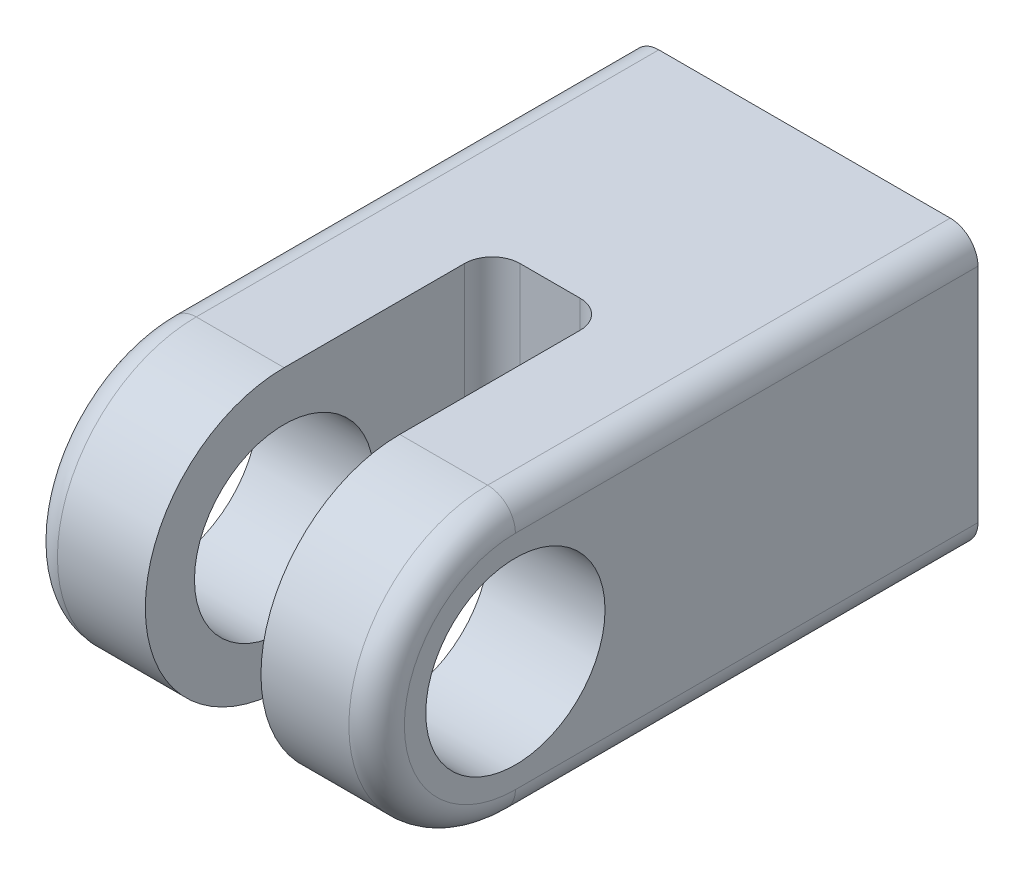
from build123d import *

# Parameters (mm, degrees)
EXTRUDE1_DEPTH          = 9.525
CUT_EXTRUDE1_DEPTH      = 36.201000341
CUT_EXTRUDE1_DEPTH_BACK = 36.201000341
SKETCH2_W               = 6.35
SKETCH2_H               = 19.05
SKETCH3_R               = 4.92125
CUT_EXTRUDE2_DEPTH      = 39.875278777
SKETCH4_R               = 6.35
CUT_EXTRUDE3_DEPTH      = 9.8425
FILLET1_R               = 1.524


with BuildPart() as part:
    # Sketch1 → Extrude1 (new, symmetric)
    with BuildSketch(Plane(origin=(0, 0, 0), x_dir=(0, 0, -1), z_dir=(1, 0, 0))):
        with BuildLine():
            Line((0, 7.62), (-25.4, 7.62))
            ThreePointArc((-25.4, 7.62), (-33.02, 0), (-25.4, -7.62))
            Line((-25.4, -7.62), (0, -7.62))
            Line((0, -7.62), (0, 7.62))
        make_face()
    extrude(amount=EXTRUDE1_DEPTH, both=True)

    # Sketch2 → Cut-Extrude1 (cut, two sides: drawn at the far end of the back side and taken through both)
    with BuildSketch(Plane(origin=(0, 0, 0), x_dir=(1, 0, 0), z_dir=(0, 1, 0)).offset(-CUT_EXTRUDE1_DEPTH_BACK)):
        with Locations((0, -23.495)):
            Rectangle(SKETCH2_W, SKETCH2_H)
    extrude(amount=CUT_EXTRUDE1_DEPTH + CUT_EXTRUDE1_DEPTH_BACK, mode=Mode.SUBTRACT)

    # Sketch3 → Cut-Extrude2 (cut, through all)
    with BuildSketch(Plane(origin=(9.525, 0, 0), x_dir=(0, 0, -1), z_dir=(1, 0, 0))):
        with Locations((-25.4, 0)):
            Circle(SKETCH3_R)
    extrude(amount=-CUT_EXTRUDE2_DEPTH, mode=Mode.SUBTRACT)

    # Sketch4 → Cut-Extrude3 (cut)
    with BuildSketch(Plane(origin=(0, 0, 0), x_dir=(-1, 0, 0), z_dir=(0, 0, -1))):
        Circle(SKETCH4_R)
    extrude(amount=-CUT_EXTRUDE3_DEPTH, mode=Mode.SUBTRACT)

    # Fillet1
    fillet1_edges = [part.edges().sort_by_distance(p)[0] for p in [
        (9.525, 0, 33.02),
        (9.525, -7.62, 12.7),
        (3.175, 0, 13.97),
        (-3.175, 0, 13.97),
        (-9.525, -7.62, 12.7),
        (-9.525, 0, 33.02),
        (-9.525, 7.62, 12.7),
        (9.525, 7.62, 12.7),
    ]]
    fillet(fillet1_edges, radius=FILLET1_R)


solid = part.part
